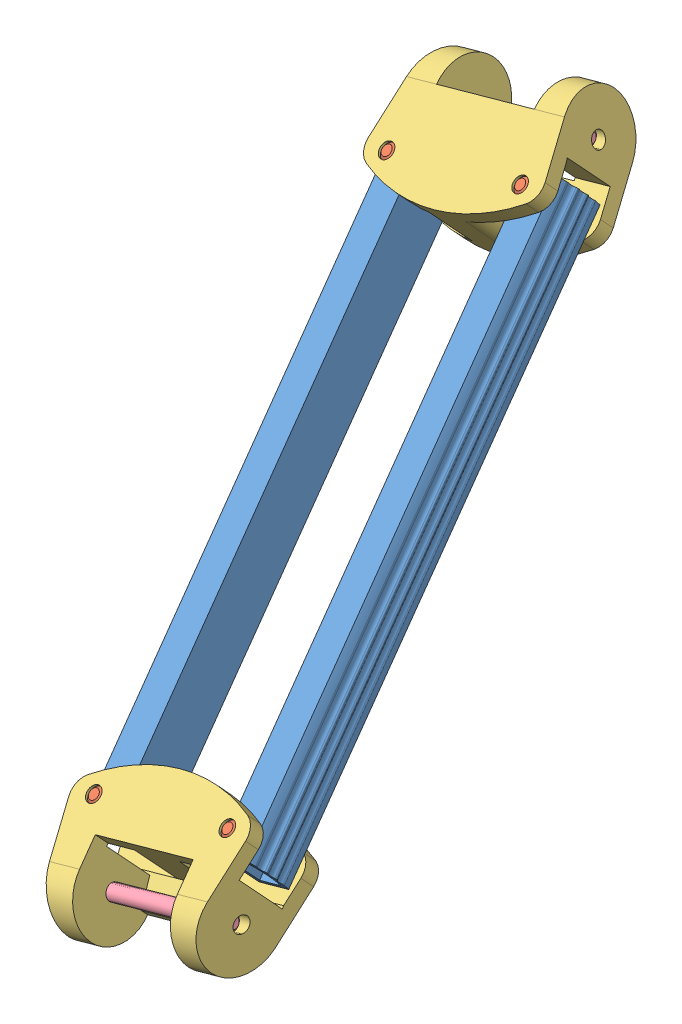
SolidWorks assembly ensemble bielle.SLDASM, configuration Défaut (file format 12000). Lengths in mm.
Overall size (65.69 117.27 120.79).
14 component instances, 4 part files, 7 mates.
Components (placement in the parent):
- BIELLE PARALLELOGRAMME-1: BIELLE PARALLELOGRAMME.SLDASM [Défaut] at (183.239 66.8785 72.6346) x (0.96335 0.268247 0) z (0.176423 -0.633583 0.753291) size (7.16 16 109)
  - BIELLE PARALLELOGRAMME-1: BIELLE PARALLELOGRAMME.SLDPRT [Défaut] at (-178.1288 5 -54.5) x (0 -1 0) z (0 0 -1) size (10 7.16 109)
  - AXE BIELLE-1: AXE BIELLE.SLDPRT [Défaut] at (-181.1288 5 -105.75) x (0.623444 0 0.781868) z (0 1 0) size (3 3 16)
  - AXE BIELLE-2: AXE BIELLE.SLDPRT [Défaut] at (-181.1288 5 -3.25) x (0.623444 0 0.781868) z (0 1 0) size (3 3 16)
- joint-1: joint.SLDASM [Défaut] at (-149.4515 13.7221 -104.858) x (-0.96335 -0.268247 0) z (-0.215349 0.773377 -0.596248) size (37.18 21.16 28.81)
  - joint-1: joint.SLDPRT [Défaut] at (-167.6277 128.0999 -150.9355) x (1 0 0) z (0 -0.97714 -0.212597) size (37.18 26 16)
  - AXE BRAS-1: AXE BRAS.SLDPRT [Défaut] at (-167.6277 126.3991 -143.1184) x (0 0 1) z (-1 0 0) size (3 3 30)
- joint-2: joint.SLDASM [Défaut] at (-150.2967 16.7572 174.5953) x (-0.96335 -0.268247 0) z (0.215349 -0.773377 0.596248) size (37.18 21.16 28.81)
  - joint-1: joint.SLDPRT [Défaut] at (-167.6277 128.0999 -150.9355) x (1 0 0) z (0 -0.97714 -0.212597) size (37.18 26 16)
  - AXE BRAS-1: AXE BRAS.SLDPRT [Défaut] at (-167.6277 126.3991 -143.1184) x (0 0 1) z (-1 0 0) size (3 3 30)
- BIELLE PARALLELOGRAMME-2: BIELLE PARALLELOGRAMME.SLDASM [Défaut] at (-140.7887 -15.5284 79.2114) x (-0.96335 -0.268247 0) z (0.176423 -0.633583 0.753291) size (7.16 16 109)
  - BIELLE PARALLELOGRAMME-1: BIELLE PARALLELOGRAMME.SLDPRT [Défaut] at (-178.1288 5 -54.5) x (0 -1 0) z (0 0 -1) size (10 7.16 109)
  - AXE BIELLE-1: AXE BIELLE.SLDPRT [Défaut] at (-181.1288 5 -105.75) x (0.623444 0 0.781868) z (0 1 0) size (3 3 16)
  - AXE BIELLE-2: AXE BIELLE.SLDPRT [Défaut] at (-181.1288 5 -3.25) x (0.623444 0 0.781868) z (0 1 0) size (3 3 16)
Mates (geometry in assembly coordinates):
- Coaxiale85: concentric anti-aligned: cylinder of BIELLE PARALLELOGRAMME-1/AXE BIELLE-2 through (5.5483 29.7842 78.7363) axis (0.202068 -0.725683 -0.657687) radius 1.5; cylinder of joint-1/joint-1 through (8.7814 18.1733 68.2133) axis (-0.202068 0.725683 0.657687) radius 1.5
- Coaxiale84: concentric aligned: cylinder of BIELLE PARALLELOGRAMME-1/AXE BIELLE-1 through (-12.5351 94.7265 1.524) axis (0.202068 -0.725683 -0.657687) radius 1.5; cylinder of joint-2/joint-1 through (-12.5351 94.7265 1.524) axis (0.202068 -0.725683 -0.657687) radius 1.5
- Coïncidente80: coincident anti-aligned: plane of BIELLE PARALLELOGRAMME-1/BIELLE PARALLELOGRAMME-1 through (-9.6122 95.4133 -2.8973) normal (-0.202068 0.725683 0.657687); plane of joint-2/joint-1 through (-3.5261 114.5636 -22.1576) normal (0.202068 -0.725683 -0.657687)
- Coaxiale86: concentric aligned: cylinder of BIELLE PARALLELOGRAMME-2/AXE BIELLE-2 through (35.7552 25.6842 68.2133) axis (-0.202068 0.725683 0.657687) radius 1.5; cylinder of joint-1/joint-1 through (35.7552 25.6842 68.2133) axis (-0.202068 0.725683 0.657687) radius 1.5
- Coïncidente81: coincident anti-aligned: plane of BIELLE PARALLELOGRAMME-2/BIELLE PARALLELOGRAMME-1 through (11.5815 101.3147 -2.8973) normal (-0.202068 0.725683 0.657687); plane of joint-1/joint-1 through (24.7256 13.1039 98.4717) normal (0.202068 -0.725683 -0.657687)
- Coaxiale89: concentric anti-aligned: cylinder of BIELLE PARALLELOGRAMME-2/AXE BIELLE-1 through (17.6718 90.6265 -8.999) axis (-0.202068 0.725683 0.657687) radius 1.5; cylinder of joint-2/joint-1 through (14.4387 102.2374 1.524) axis (0.202068 -0.725683 -0.657687) radius 1.5
- Coïncidente84: coincident anti-aligned: plane of BIELLE PARALLELOGRAMME-2/BIELLE PARALLELOGRAMME-1 through (13.6022 94.0579 -9.4741) normal (0.202068 -0.725683 -0.657687); plane of joint-2/joint-1 through (-1.5055 107.3068 -28.7344) normal (-0.202068 0.725683 0.657687)
